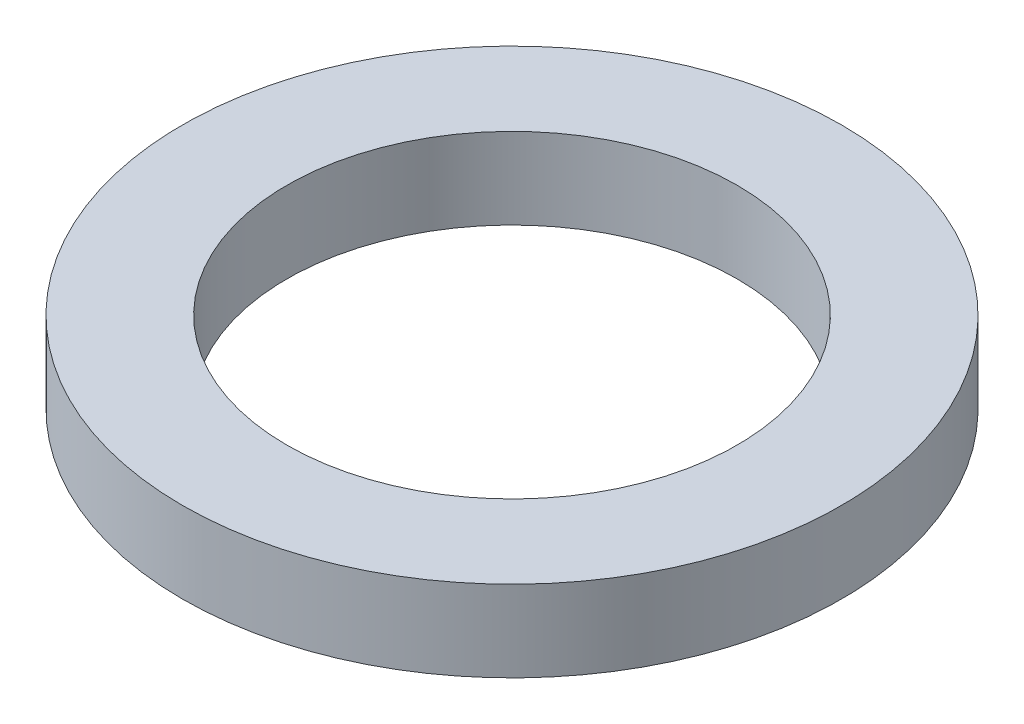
ISO-10303-21;
HEADER;
FILE_DESCRIPTION(('STEP AP214'),'2;1');
FILE_NAME('part.step','',(''),(''),'','','');
FILE_SCHEMA(('AUTOMOTIVE_DESIGN { 1 0 10303 214 1 1 1 1 }'));
ENDSEC;
DATA;
#1=APPLICATION_CONTEXT('core data for automotive mechanical design processes');
#2=APPLICATION_PROTOCOL_DEFINITION('international standard','automotive_design',2000,#1);
#3=PRODUCT_CONTEXT('',#1,'mechanical');
#4=PRODUCT('Part','Part','',(#3));
#5=PRODUCT_RELATED_PRODUCT_CATEGORY('part','',(#4));
#6=PRODUCT_DEFINITION_FORMATION('','',#4);
#7=PRODUCT_DEFINITION_CONTEXT('part definition',#1,'design');
#8=PRODUCT_DEFINITION('design','',#6,#7);
#9=PRODUCT_DEFINITION_SHAPE('','',#8);
#10=(LENGTH_UNIT() NAMED_UNIT(*) SI_UNIT(.MILLI.,.METRE.));
#11=(NAMED_UNIT(*) PLANE_ANGLE_UNIT() SI_UNIT($,.RADIAN.));
#12=(NAMED_UNIT(*) SI_UNIT($,.STERADIAN.) SOLID_ANGLE_UNIT());
#13=UNCERTAINTY_MEASURE_WITH_UNIT(LENGTH_MEASURE(1.E-05),#10,'distance_accuracy_value','');
#14=(GEOMETRIC_REPRESENTATION_CONTEXT(3) GLOBAL_UNCERTAINTY_ASSIGNED_CONTEXT((#13)) GLOBAL_UNIT_ASSIGNED_CONTEXT((#10,
#11,#12)) REPRESENTATION_CONTEXT('',''));
#15=CARTESIAN_POINT('',(0.,0.,0.));
#16=DIRECTION('',(0.,0.,1.));
#17=DIRECTION('',(1.,0.,0.));
#18=AXIS2_PLACEMENT_3D('',#15,#16,#17);
#19=CARTESIAN_POINT('',(0.,2.00642158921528,0.));
#20=DIRECTION('',(0.,1.,0.));
#21=DIRECTION('',(0.,0.,1.));
#22=AXIS2_PLACEMENT_3D('',#19,#20,#21);
#23=CYLINDRICAL_SURFACE('',#22,11.1);
#24=CARTESIAN_POINT('',(0.,-4.,0.));
#25=DIRECTION('',(0.,1.,0.));
#26=DIRECTION('',(0.,0.,1.));
#27=AXIS2_PLACEMENT_3D('',#24,#25,#26);
#28=CIRCLE('',#27,11.1);
#29=CARTESIAN_POINT('',(0.,-4.,11.1));
#30=VERTEX_POINT('',#29);
#31=EDGE_CURVE('E10',#30,#30,#28,.T.);
#32=ORIENTED_EDGE('',*,*,#31,.F.);
#33=EDGE_LOOP('',(#32));
#34=FACE_BOUND('',#33,.T.);
#35=CARTESIAN_POINT('',(0.,0.,0.));
#36=DIRECTION('',(0.,1.,0.));
#37=DIRECTION('',(0.,0.,1.));
#38=AXIS2_PLACEMENT_3D('',#35,#36,#37);
#39=CIRCLE('',#38,11.1);
#40=CARTESIAN_POINT('',(0.,0.,11.1));
#41=VERTEX_POINT('',#40);
#42=EDGE_CURVE('E50',#41,#41,#39,.T.);
#43=ORIENTED_EDGE('',*,*,#42,.T.);
#44=EDGE_LOOP('',(#43));
#45=FACE_BOUND('',#44,.T.);
#46=ADVANCED_FACE('F31',(#34,#45),#23,.F.);
#47=CARTESIAN_POINT('',(0.,-4.,0.));
#48=DIRECTION('',(0.,1.,0.));
#49=DIRECTION('',(0.,0.,1.));
#50=AXIS2_PLACEMENT_3D('',#47,#48,#49);
#51=CONICAL_SURFACE('',#50,11.1,0.872664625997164);
#52=CARTESIAN_POINT('',(0.,-1.8393184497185,0.));
#53=DIRECTION('',(0.,1.,0.));
#54=DIRECTION('',(0.,0.,1.));
#55=AXIS2_PLACEMENT_3D('',#52,#53,#54);
#56=CIRCLE('',#55,13.675);
#57=CARTESIAN_POINT('',(0.,-1.8393184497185,13.675));
#58=VERTEX_POINT('',#57);
#59=EDGE_CURVE('E37',#58,#58,#56,.T.);
#60=ORIENTED_EDGE('',*,*,#59,.F.);
#61=EDGE_LOOP('',(#60));
#62=FACE_BOUND('',#61,.T.);
#63=ORIENTED_EDGE('',*,*,#31,.T.);
#64=EDGE_LOOP('',(#63));
#65=FACE_BOUND('',#64,.T.);
#66=ADVANCED_FACE('F69',(#62,#65),#51,.T.);
#67=CARTESIAN_POINT('',(0.,-1.8393184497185,0.));
#68=DIRECTION('',(0.,-1.,0.));
#69=DIRECTION('',(0.,0.,-1.));
#70=AXIS2_PLACEMENT_3D('',#67,#68,#69);
#71=CONICAL_SURFACE('',#70,13.675,0.872664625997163);
#72=CARTESIAN_POINT('',(0.,-4.,0.));
#73=DIRECTION('',(0.,1.,0.));
#74=DIRECTION('',(0.,0.,1.));
#75=AXIS2_PLACEMENT_3D('',#72,#73,#74);
#76=CIRCLE('',#75,16.25);
#77=CARTESIAN_POINT('',(0.,-4.,16.25));
#78=VERTEX_POINT('',#77);
#79=EDGE_CURVE('E41',#78,#78,#76,.T.);
#80=ORIENTED_EDGE('',*,*,#79,.F.);
#81=EDGE_LOOP('',(#80));
#82=FACE_BOUND('',#81,.T.);
#83=ORIENTED_EDGE('',*,*,#59,.T.);
#84=EDGE_LOOP('',(#83));
#85=FACE_BOUND('',#84,.T.);
#86=ADVANCED_FACE('F64',(#82,#85),#71,.F.);
#87=CARTESIAN_POINT('',(0.,2.00642158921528,0.));
#88=DIRECTION('',(0.,1.,0.));
#89=DIRECTION('',(0.,0.,1.));
#90=AXIS2_PLACEMENT_3D('',#87,#88,#89);
#91=CYLINDRICAL_SURFACE('',#90,16.25);
#92=CARTESIAN_POINT('',(0.,0.,0.));
#93=DIRECTION('',(0.,1.,0.));
#94=DIRECTION('',(0.,0.,1.));
#95=AXIS2_PLACEMENT_3D('',#92,#93,#94);
#96=CIRCLE('',#95,16.25);
#97=CARTESIAN_POINT('',(0.,0.,16.25));
#98=VERTEX_POINT('',#97);
#99=EDGE_CURVE('E45',#98,#98,#96,.T.);
#100=ORIENTED_EDGE('',*,*,#99,.F.);
#101=EDGE_LOOP('',(#100));
#102=FACE_BOUND('',#101,.T.);
#103=ORIENTED_EDGE('',*,*,#79,.T.);
#104=EDGE_LOOP('',(#103));
#105=FACE_BOUND('',#104,.T.);
#106=ADVANCED_FACE('F58',(#102,#105),#91,.T.);
#107=CARTESIAN_POINT('',(0.,0.,-11.1));
#108=DIRECTION('',(0.,-1.,0.));
#109=DIRECTION('',(0.,0.,-1.));
#110=AXIS2_PLACEMENT_3D('',#107,#108,#109);
#111=PLANE('',#110);
#112=ORIENTED_EDGE('',*,*,#42,.F.);
#113=EDGE_LOOP('',(#112));
#114=FACE_BOUND('',#113,.T.);
#115=ORIENTED_EDGE('',*,*,#99,.T.);
#116=EDGE_LOOP('',(#115));
#117=FACE_BOUND('',#116,.T.);
#118=ADVANCED_FACE('F55',(#114,#117),#111,.F.);
#119=CLOSED_SHELL('',(#46,#66,#86,#106,#118));
#120=MANIFOLD_SOLID_BREP('B2',#119);
#121=ADVANCED_BREP_SHAPE_REPRESENTATION('',(#18,#120),#14);
#122=SHAPE_DEFINITION_REPRESENTATION(#9,#121);
ENDSEC;
END-ISO-10303-21;
